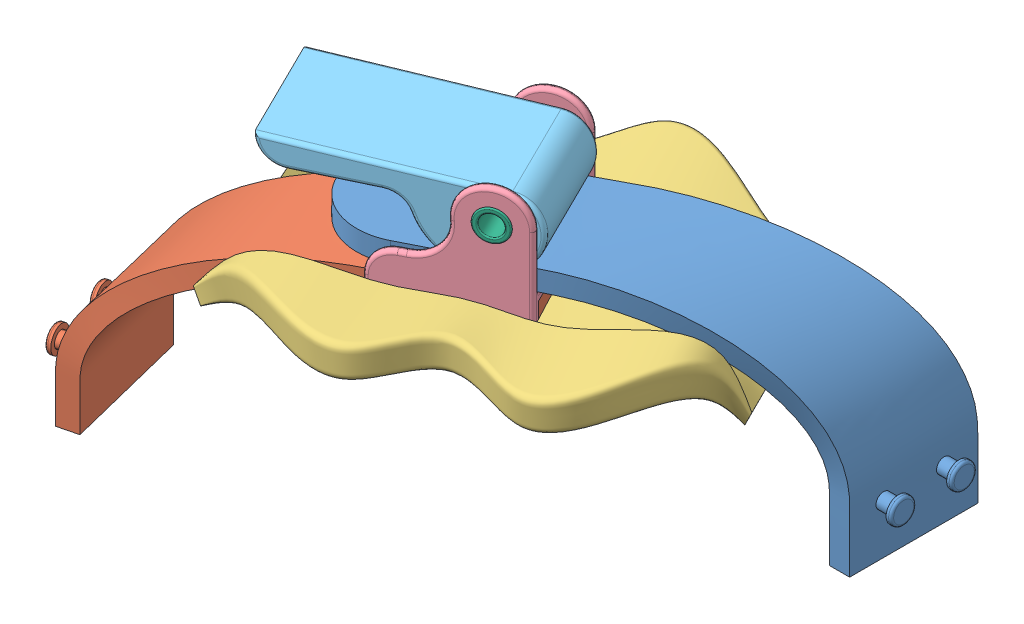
SolidWorks assembly Strap Assembly_&.SLDASM, configuration Default (file format 5000). Lengths in mm.
Overall size (117.61 65.33 88.22).
7 component instances, 6 part files, 3 mates.
Components (placement in the parent):
- Strap_right_&-1: Strap_right_&.SLDPRT [Default] at origin size (88.83 43.09 59.62)
- Strap_left_&-1: Strap_left_&.SLDPRT [Default] at origin size (73.06 42.82 54.1)
- Foam_Pad_&-1: Foam_Pad_&.SLDPRT [Default] at origin size (84.94 21.8 88.22)
- Clasp assembly_&-1: Clasp assembly_&.SLDASM [Default] at (-46.1774 37.2872 35.4982) x (0.896672 -0.000538 -0.442696) z (0.442696 0 0.896672) size (47.96 32.78 27.57)
  - Clasp-1_&-1: Clasp-1_&.SLDPRT [Default] at origin size (25.4 23.81 26.99)
  - Clasp-2a_&-1: Clasp-2a_&.SLDPRT [Default] at (-6.35 12.7 0) x (0.961736 -0.273977 0) z (0 0 1) size (44.97 17.22 22.68)
  - Clasp-pin_&-1: Clasp-pin_&.SLDPRT [Default] at (-6.35 12.7 0) x (0 0 1) z (-1 0 0) size (27.57 6.1 6.1)
Mates (geometry in assembly coordinates):
- Tangent1: tangent: face of ?; plane of Clasp assembly_&-1/Clasp-1_&-1 through (-63.682 37.3009 57.4187) normal (-0.000482 -1 0.000238)
- Coincident1: coincident: moEndPointRef_w of ?; point of Clasp assembly_&-1/Clasp-1_&-1
- Coincident2: coincident: point of ?; line of Clasp assembly_&-1/Clasp-1_&-1 through (-51.4482 37.2872 24.8222) axis (0.442696 0 0.896672)
